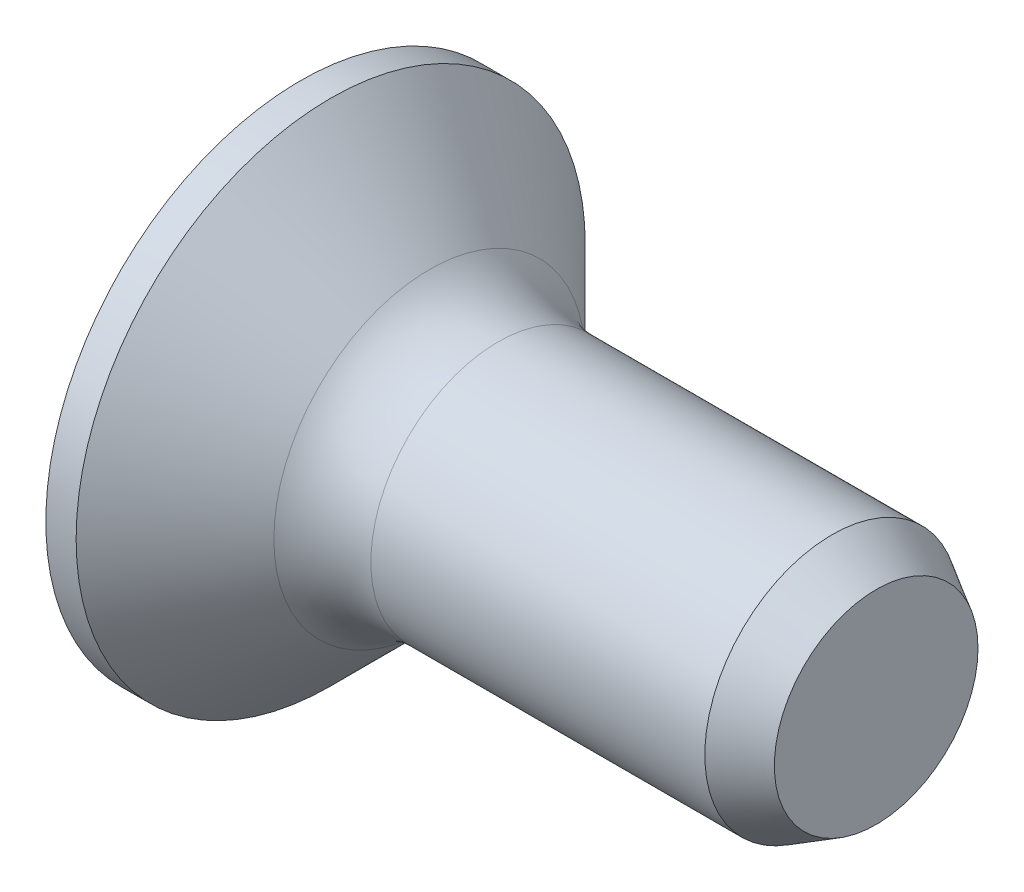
ISO-10303-21;
HEADER;
FILE_DESCRIPTION(('STEP AP214'),'2;1');
FILE_NAME('part.step','',(''),(''),'','','');
FILE_SCHEMA(('AUTOMOTIVE_DESIGN { 1 0 10303 214 1 1 1 1 }'));
ENDSEC;
DATA;
#1=APPLICATION_CONTEXT('core data for automotive mechanical design processes');
#2=APPLICATION_PROTOCOL_DEFINITION('international standard','automotive_design',2000,#1);
#3=PRODUCT_CONTEXT('',#1,'mechanical');
#4=PRODUCT('Part','Part','',(#3));
#5=PRODUCT_RELATED_PRODUCT_CATEGORY('part','',(#4));
#6=PRODUCT_DEFINITION_FORMATION('','',#4);
#7=PRODUCT_DEFINITION_CONTEXT('part definition',#1,'design');
#8=PRODUCT_DEFINITION('design','',#6,#7);
#9=PRODUCT_DEFINITION_SHAPE('','',#8);
#10=(LENGTH_UNIT() NAMED_UNIT(*) SI_UNIT(.MILLI.,.METRE.));
#11=(NAMED_UNIT(*) PLANE_ANGLE_UNIT() SI_UNIT($,.RADIAN.));
#12=(NAMED_UNIT(*) SI_UNIT($,.STERADIAN.) SOLID_ANGLE_UNIT());
#13=UNCERTAINTY_MEASURE_WITH_UNIT(LENGTH_MEASURE(1.E-05),#10,'distance_accuracy_value','');
#14=(GEOMETRIC_REPRESENTATION_CONTEXT(3) GLOBAL_UNCERTAINTY_ASSIGNED_CONTEXT((#13)) GLOBAL_UNIT_ASSIGNED_CONTEXT((#10,
#11,#12)) REPRESENTATION_CONTEXT('',''));
#15=CARTESIAN_POINT('',(0.,0.,0.));
#16=DIRECTION('',(0.,0.,1.));
#17=DIRECTION('',(1.,0.,0.));
#18=AXIS2_PLACEMENT_3D('',#15,#16,#17);
#19=CARTESIAN_POINT('',(0.,0.575,0.574999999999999));
#20=DIRECTION('',(-0.139173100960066,-0.99026806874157,0.));
#21=DIRECTION('',(0.99026806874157,-0.139173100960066,0.));
#22=AXIS2_PLACEMENT_3D('',#19,#20,#21);
#23=PLANE('',#22);
#24=DIRECTION('',(-0.980814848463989,0.137844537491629,0.137844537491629));
#25=VECTOR('',#24,1.);
#26=CARTESIAN_POINT('',(2.1,0.279864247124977,0.554714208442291));
#27=LINE('',#26,#25);
#28=CARTESIAN_POINT('',(2.1,0.279864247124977,0.554714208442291));
#29=VERTEX_POINT('',#28);
#30=CARTESIAN_POINT('',(0.,0.575000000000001,0.849849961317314));
#31=VERTEX_POINT('',#30);
#32=EDGE_CURVE('E378',#29,#31,#27,.T.);
#33=ORIENTED_EDGE('',*,*,#32,.F.);
#34=DIRECTION('',(0.,0.,1.));
#35=VECTOR('',#34,1.);
#36=CARTESIAN_POINT('',(2.1,0.279864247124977,0.574999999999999));
#37=LINE('',#36,#35);
#38=CARTESIAN_POINT('',(2.1,0.279864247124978,0.829564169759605));
#39=VERTEX_POINT('',#38);
#40=EDGE_CURVE('E217',#39,#29,#37,.F.);
#41=ORIENTED_EDGE('',*,*,#40,.F.);
#42=DIRECTION('',(-0.813777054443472,0.114368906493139,0.569812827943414));
#43=VECTOR('',#42,1.);
#44=CARTESIAN_POINT('',(0.,0.575000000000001,2.3));
#45=LINE('',#44,#43);
#46=CARTESIAN_POINT('',(0.,0.575000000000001,2.3));
#47=VERTEX_POINT('',#46);
#48=EDGE_CURVE('E212',#39,#47,#45,.T.);
#49=ORIENTED_EDGE('',*,*,#48,.T.);
#50=DIRECTION('',(0.,0.,-1.));
#51=VECTOR('',#50,1.);
#52=CARTESIAN_POINT('',(0.,0.575,0.574999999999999));
#53=LINE('',#52,#51);
#54=EDGE_CURVE('E299',#47,#31,#53,.T.);
#55=ORIENTED_EDGE('',*,*,#54,.T.);
#56=EDGE_LOOP('',(#33,#41,#49,#55));
#57=FACE_BOUND('',#56,.T.);
#58=ADVANCED_FACE('F104',(#57),#23,.T.);
#59=CARTESIAN_POINT('',(0.,-0.575,0.574999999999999));
#60=DIRECTION('',(-0.139173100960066,0.99026806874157,0.));
#61=DIRECTION('',(-0.99026806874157,-0.139173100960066,0.));
#62=AXIS2_PLACEMENT_3D('',#59,#60,#61);
#63=PLANE('',#62);
#64=DIRECTION('',(-0.980814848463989,-0.137844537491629,0.137844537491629));
#65=VECTOR('',#64,1.);
#66=CARTESIAN_POINT('',(1.05,-0.427432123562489,0.702282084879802));
#67=LINE('',#66,#65);
#68=CARTESIAN_POINT('',(2.1,-0.279864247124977,0.554714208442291));
#69=VERTEX_POINT('',#68);
#70=CARTESIAN_POINT('',(0.,-0.575000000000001,0.849849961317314));
#71=VERTEX_POINT('',#70);
#72=EDGE_CURVE('E432',#69,#71,#67,.T.);
#73=ORIENTED_EDGE('',*,*,#72,.T.);
#74=DIRECTION('',(0.,0.,1.));
#75=VECTOR('',#74,1.);
#76=CARTESIAN_POINT('',(0.,-0.575,0.574999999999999));
#77=LINE('',#76,#75);
#78=CARTESIAN_POINT('',(0.,-0.574999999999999,2.3));
#79=VERTEX_POINT('',#78);
#80=EDGE_CURVE('E210',#71,#79,#77,.T.);
#81=ORIENTED_EDGE('',*,*,#80,.T.);
#82=DIRECTION('',(-0.813777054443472,-0.114368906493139,0.569812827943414));
#83=VECTOR('',#82,1.);
#84=CARTESIAN_POINT('',(0.799883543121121,-0.462583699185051,1.7399155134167));
#85=LINE('',#84,#83);
#86=CARTESIAN_POINT('',(2.1,-0.279864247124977,0.829564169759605));
#87=VERTEX_POINT('',#86);
#88=EDGE_CURVE('E202',#87,#79,#85,.T.);
#89=ORIENTED_EDGE('',*,*,#88,.F.);
#90=DIRECTION('',(0.,0.,-1.));
#91=VECTOR('',#90,1.);
#92=CARTESIAN_POINT('',(2.1,-0.279864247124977,0.574999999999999));
#93=LINE('',#92,#91);
#94=EDGE_CURVE('E190',#69,#87,#93,.F.);
#95=ORIENTED_EDGE('',*,*,#94,.F.);
#96=EDGE_LOOP('',(#73,#81,#89,#95));
#97=FACE_BOUND('',#96,.T.);
#98=ADVANCED_FACE('F203',(#97),#63,.T.);
#99=CARTESIAN_POINT('',(0.,-0.575,0.574999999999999));
#100=DIRECTION('',(-0.139173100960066,0.,-0.99026806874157));
#101=DIRECTION('',(-0.99026806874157,0.,0.139173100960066));
#102=AXIS2_PLACEMENT_3D('',#99,#100,#101);
#103=PLANE('',#102);
#104=DIRECTION('',(-0.980814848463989,-0.137844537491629,0.13784453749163));
#105=VECTOR('',#104,1.);
#106=CARTESIAN_POINT('',(2.1,-0.554714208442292,0.279864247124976));
#107=LINE('',#106,#105);
#108=CARTESIAN_POINT('',(2.1,-0.554714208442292,0.279864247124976));
#109=VERTEX_POINT('',#108);
#110=CARTESIAN_POINT('',(0.,-0.849849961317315,0.575000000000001));
#111=VERTEX_POINT('',#110);
#112=EDGE_CURVE('E430',#109,#111,#107,.T.);
#113=ORIENTED_EDGE('',*,*,#112,.F.);
#114=DIRECTION('',(0.,-1.,0.));
#115=VECTOR('',#114,1.);
#116=CARTESIAN_POINT('',(2.1,-0.575,0.279864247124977));
#117=LINE('',#116,#115);
#118=CARTESIAN_POINT('',(2.1,-0.829564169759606,0.279864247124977));
#119=VERTEX_POINT('',#118);
#120=EDGE_CURVE('E197',#119,#109,#117,.F.);
#121=ORIENTED_EDGE('',*,*,#120,.F.);
#122=DIRECTION('',(-0.813777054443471,-0.569812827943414,0.11436890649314));
#123=VECTOR('',#122,1.);
#124=CARTESIAN_POINT('',(0.107031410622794,-2.2250557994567,0.559957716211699));
#125=LINE('',#124,#123);
#126=CARTESIAN_POINT('',(0.,-2.3,0.575000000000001));
#127=VERTEX_POINT('',#126);
#128=EDGE_CURVE('E183',#119,#127,#125,.T.);
#129=ORIENTED_EDGE('',*,*,#128,.T.);
#130=DIRECTION('',(0.,1.,0.));
#131=VECTOR('',#130,1.);
#132=CARTESIAN_POINT('',(0.,-0.575,0.574999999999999));
#133=LINE('',#132,#131);
#134=EDGE_CURVE('E290',#127,#111,#133,.T.);
#135=ORIENTED_EDGE('',*,*,#134,.T.);
#136=EDGE_LOOP('',(#113,#121,#129,#135));
#137=FACE_BOUND('',#136,.T.);
#138=ADVANCED_FACE('F529',(#137),#103,.T.);
#139=CARTESIAN_POINT('',(0.,-0.575,-0.574999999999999));
#140=DIRECTION('',(-0.139173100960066,0.,0.99026806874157));
#141=DIRECTION('',(0.99026806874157,0.,0.139173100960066));
#142=AXIS2_PLACEMENT_3D('',#139,#140,#141);
#143=PLANE('',#142);
#144=DIRECTION('',(-0.980814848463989,-0.137844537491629,-0.137844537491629));
#145=VECTOR('',#144,1.);
#146=CARTESIAN_POINT('',(1.05,-0.702282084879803,-0.427432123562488));
#147=LINE('',#146,#145);
#148=CARTESIAN_POINT('',(2.1,-0.554714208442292,-0.279864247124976));
#149=VERTEX_POINT('',#148);
#150=CARTESIAN_POINT('',(0.,-0.849849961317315,-0.574999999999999));
#151=VERTEX_POINT('',#150);
#152=EDGE_CURVE('E425',#149,#151,#147,.T.);
#153=ORIENTED_EDGE('',*,*,#152,.T.);
#154=DIRECTION('',(0.,-1.,0.));
#155=VECTOR('',#154,1.);
#156=CARTESIAN_POINT('',(0.,-0.575,-0.574999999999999));
#157=LINE('',#156,#155);
#158=CARTESIAN_POINT('',(0.,-2.3,-0.575000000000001));
#159=VERTEX_POINT('',#158);
#160=EDGE_CURVE('E284',#151,#159,#157,.T.);
#161=ORIENTED_EDGE('',*,*,#160,.T.);
#162=DIRECTION('',(-0.813777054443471,-0.569812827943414,-0.11436890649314));
#163=VECTOR('',#162,1.);
#164=CARTESIAN_POINT('',(0.799883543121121,-1.7399155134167,-0.462583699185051));
#165=LINE('',#164,#163);
#166=CARTESIAN_POINT('',(2.1,-0.829564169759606,-0.279864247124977));
#167=VERTEX_POINT('',#166);
#168=EDGE_CURVE('E242',#167,#159,#165,.T.);
#169=ORIENTED_EDGE('',*,*,#168,.F.);
#170=DIRECTION('',(0.,1.,0.));
#171=VECTOR('',#170,1.);
#172=CARTESIAN_POINT('',(2.1,-0.575,-0.279864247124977));
#173=LINE('',#172,#171);
#174=EDGE_CURVE('E226',#149,#167,#173,.F.);
#175=ORIENTED_EDGE('',*,*,#174,.F.);
#176=EDGE_LOOP('',(#153,#161,#169,#175));
#177=FACE_BOUND('',#176,.T.);
#178=ADVANCED_FACE('F535',(#177),#143,.T.);
#179=CARTESIAN_POINT('',(0.,-0.575,-0.574999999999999));
#180=DIRECTION('',(-0.139173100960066,0.99026806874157,0.));
#181=DIRECTION('',(-0.99026806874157,-0.139173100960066,0.));
#182=AXIS2_PLACEMENT_3D('',#179,#180,#181);
#183=PLANE('',#182);
#184=DIRECTION('',(-0.980814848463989,-0.137844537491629,-0.137844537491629));
#185=VECTOR('',#184,1.);
#186=CARTESIAN_POINT('',(2.1,-0.279864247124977,-0.554714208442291));
#187=LINE('',#186,#185);
#188=CARTESIAN_POINT('',(2.1,-0.279864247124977,-0.554714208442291));
#189=VERTEX_POINT('',#188);
#190=CARTESIAN_POINT('',(0.,-0.575,-0.849849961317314));
#191=VERTEX_POINT('',#190);
#192=EDGE_CURVE('E415',#189,#191,#187,.T.);
#193=ORIENTED_EDGE('',*,*,#192,.F.);
#194=DIRECTION('',(0.,0.,-1.));
#195=VECTOR('',#194,1.);
#196=CARTESIAN_POINT('',(2.1,-0.279864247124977,-0.574999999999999));
#197=LINE('',#196,#195);
#198=CARTESIAN_POINT('',(2.1,-0.279864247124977,-0.829564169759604));
#199=VERTEX_POINT('',#198);
#200=EDGE_CURVE('E232',#199,#189,#197,.F.);
#201=ORIENTED_EDGE('',*,*,#200,.F.);
#202=DIRECTION('',(-0.813777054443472,-0.114368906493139,-0.569812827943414));
#203=VECTOR('',#202,1.);
#204=CARTESIAN_POINT('',(0.107031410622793,-0.559957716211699,-2.2250557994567));
#205=LINE('',#204,#203);
#206=CARTESIAN_POINT('',(0.,-0.575,-2.3));
#207=VERTEX_POINT('',#206);
#208=EDGE_CURVE('E239',#199,#207,#205,.T.);
#209=ORIENTED_EDGE('',*,*,#208,.T.);
#210=DIRECTION('',(0.,0.,1.));
#211=VECTOR('',#210,1.);
#212=CARTESIAN_POINT('',(0.,-0.575,-0.574999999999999));
#213=LINE('',#212,#211);
#214=EDGE_CURVE('E276',#207,#191,#213,.T.);
#215=ORIENTED_EDGE('',*,*,#214,.T.);
#216=EDGE_LOOP('',(#193,#201,#209,#215));
#217=FACE_BOUND('',#216,.T.);
#218=ADVANCED_FACE('F520',(#217),#183,.T.);
#219=CARTESIAN_POINT('',(0.,0.575,-0.574999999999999));
#220=DIRECTION('',(-0.139173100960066,-0.99026806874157,0.));
#221=DIRECTION('',(0.99026806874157,-0.139173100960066,0.));
#222=AXIS2_PLACEMENT_3D('',#219,#220,#221);
#223=PLANE('',#222);
#224=DIRECTION('',(-0.980814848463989,0.137844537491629,-0.137844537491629));
#225=VECTOR('',#224,1.);
#226=CARTESIAN_POINT('',(1.05,0.427432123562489,-0.702282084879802));
#227=LINE('',#226,#225);
#228=CARTESIAN_POINT('',(2.1,0.279864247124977,-0.55471420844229));
#229=VERTEX_POINT('',#228);
#230=CARTESIAN_POINT('',(0.,0.575,-0.849849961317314));
#231=VERTEX_POINT('',#230);
#232=EDGE_CURVE('E410',#229,#231,#227,.T.);
#233=ORIENTED_EDGE('',*,*,#232,.T.);
#234=DIRECTION('',(0.,0.,-1.));
#235=VECTOR('',#234,1.);
#236=CARTESIAN_POINT('',(0.,0.575,-0.574999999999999));
#237=LINE('',#236,#235);
#238=CARTESIAN_POINT('',(0.,0.574999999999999,-2.3));
#239=VERTEX_POINT('',#238);
#240=EDGE_CURVE('E262',#231,#239,#237,.T.);
#241=ORIENTED_EDGE('',*,*,#240,.T.);
#242=DIRECTION('',(-0.813777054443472,0.114368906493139,-0.569812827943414));
#243=VECTOR('',#242,1.);
#244=CARTESIAN_POINT('',(0.799883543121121,0.462583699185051,-1.7399155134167));
#245=LINE('',#244,#243);
#246=CARTESIAN_POINT('',(2.1,0.279864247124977,-0.829564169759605));
#247=VERTEX_POINT('',#246);
#248=EDGE_CURVE('E245',#247,#239,#245,.T.);
#249=ORIENTED_EDGE('',*,*,#248,.F.);
#250=DIRECTION('',(0.,0.,1.));
#251=VECTOR('',#250,1.);
#252=CARTESIAN_POINT('',(2.1,0.279864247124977,-0.574999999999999));
#253=LINE('',#252,#251);
#254=EDGE_CURVE('E235',#229,#247,#253,.F.);
#255=ORIENTED_EDGE('',*,*,#254,.F.);
#256=EDGE_LOOP('',(#233,#241,#249,#255));
#257=FACE_BOUND('',#256,.T.);
#258=ADVANCED_FACE('F514',(#257),#223,.T.);
#259=CARTESIAN_POINT('',(0.,2.3,-0.575));
#260=DIRECTION('',(-0.139173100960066,0.,0.99026806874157));
#261=DIRECTION('',(0.99026806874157,0.,0.139173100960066));
#262=AXIS2_PLACEMENT_3D('',#259,#260,#261);
#263=PLANE('',#262);
#264=DIRECTION('',(-0.980814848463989,0.137844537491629,-0.137844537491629));
#265=VECTOR('',#264,1.);
#266=CARTESIAN_POINT('',(2.1,0.554714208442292,-0.279864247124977));
#267=LINE('',#266,#265);
#268=CARTESIAN_POINT('',(2.1,0.554714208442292,-0.279864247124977));
#269=VERTEX_POINT('',#268);
#270=CARTESIAN_POINT('',(0.,0.849849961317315,-0.575));
#271=VERTEX_POINT('',#270);
#272=EDGE_CURVE('E401',#269,#271,#267,.T.);
#273=ORIENTED_EDGE('',*,*,#272,.F.);
#274=DIRECTION('',(0.,1.,0.));
#275=VECTOR('',#274,1.);
#276=CARTESIAN_POINT('',(2.1,2.3,-0.279864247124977));
#277=LINE('',#276,#275);
#278=CARTESIAN_POINT('',(2.1,0.829564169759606,-0.279864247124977));
#279=VERTEX_POINT('',#278);
#280=EDGE_CURVE('E237',#279,#269,#277,.F.);
#281=ORIENTED_EDGE('',*,*,#280,.F.);
#282=DIRECTION('',(-0.813777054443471,0.569812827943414,-0.114368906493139));
#283=VECTOR('',#282,1.);
#284=CARTESIAN_POINT('',(0.,2.3,-0.575));
#285=LINE('',#284,#283);
#286=CARTESIAN_POINT('',(0.,2.3,-0.575));
#287=VERTEX_POINT('',#286);
#288=EDGE_CURVE('E249',#279,#287,#285,.T.);
#289=ORIENTED_EDGE('',*,*,#288,.T.);
#290=DIRECTION('',(0.,-1.,0.));
#291=VECTOR('',#290,1.);
#292=CARTESIAN_POINT('',(0.,2.3,-0.575));
#293=LINE('',#292,#291);
#294=EDGE_CURVE('E263',#287,#271,#293,.T.);
#295=ORIENTED_EDGE('',*,*,#294,.T.);
#296=EDGE_LOOP('',(#273,#281,#289,#295));
#297=FACE_BOUND('',#296,.T.);
#298=ADVANCED_FACE('F333',(#297),#263,.T.);
#299=CARTESIAN_POINT('',(0.,0.,0.));
#300=DIRECTION('',(-1.,0.,0.));
#301=DIRECTION('',(0.,0.,1.));
#302=AXIS2_PLACEMENT_3D('',#299,#300,#301);
#303=PLANE('',#302);
#304=CARTESIAN_POINT('',(0.,0.849849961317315,0.849849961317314));
#305=DIRECTION('',(1.,0.,0.));
#306=DIRECTION('',(0.,0.,1.));
#307=AXIS2_PLACEMENT_3D('',#304,#305,#306);
#308=CIRCLE('',#307,0.274849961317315);
#309=CARTESIAN_POINT('',(0.,0.849849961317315,0.574999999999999));
#310=VERTEX_POINT('',#309);
#311=EDGE_CURVE('E369',#31,#310,#308,.T.);
#312=ORIENTED_EDGE('',*,*,#311,.F.);
#313=ORIENTED_EDGE('',*,*,#54,.F.);
#314=DIRECTION('',(0.,1.,0.));
#315=VECTOR('',#314,1.);
#316=CARTESIAN_POINT('',(0.,0.575000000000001,2.3));
#317=LINE('',#316,#315);
#318=EDGE_CURVE('E297',#79,#47,#317,.T.);
#319=ORIENTED_EDGE('',*,*,#318,.F.);
#320=ORIENTED_EDGE('',*,*,#80,.F.);
#321=CARTESIAN_POINT('',(0.,-0.849849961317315,0.849849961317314));
#322=DIRECTION('',(1.,0.,0.));
#323=DIRECTION('',(0.,0.,1.));
#324=AXIS2_PLACEMENT_3D('',#321,#322,#323);
#325=CIRCLE('',#324,0.274849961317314);
#326=EDGE_CURVE('E314',#111,#71,#325,.T.);
#327=ORIENTED_EDGE('',*,*,#326,.F.);
#328=ORIENTED_EDGE('',*,*,#134,.F.);
#329=DIRECTION('',(0.,0.,1.));
#330=VECTOR('',#329,1.);
#331=CARTESIAN_POINT('',(0.,-2.3,-0.575000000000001));
#332=LINE('',#331,#330);
#333=EDGE_CURVE('E287',#159,#127,#332,.T.);
#334=ORIENTED_EDGE('',*,*,#333,.F.);
#335=ORIENTED_EDGE('',*,*,#160,.F.);
#336=CARTESIAN_POINT('',(0.,-0.849849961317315,-0.849849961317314));
#337=DIRECTION('',(1.,0.,0.));
#338=DIRECTION('',(0.,0.,-1.));
#339=AXIS2_PLACEMENT_3D('',#336,#337,#338);
#340=CIRCLE('',#339,0.274849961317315);
#341=EDGE_CURVE('E737',#191,#151,#340,.T.);
#342=ORIENTED_EDGE('',*,*,#341,.F.);
#343=ORIENTED_EDGE('',*,*,#214,.F.);
#344=DIRECTION('',(0.,-1.,0.));
#345=VECTOR('',#344,1.);
#346=CARTESIAN_POINT('',(0.,0.574999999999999,-2.3));
#347=LINE('',#346,#345);
#348=EDGE_CURVE('E273',#239,#207,#347,.T.);
#349=ORIENTED_EDGE('',*,*,#348,.F.);
#350=ORIENTED_EDGE('',*,*,#240,.F.);
#351=CARTESIAN_POINT('',(0.,0.849849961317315,-0.849849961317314));
#352=DIRECTION('',(1.,0.,0.));
#353=DIRECTION('',(0.,0.,-1.));
#354=AXIS2_PLACEMENT_3D('',#351,#352,#353);
#355=CIRCLE('',#354,0.274849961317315);
#356=EDGE_CURVE('E360',#271,#231,#355,.T.);
#357=ORIENTED_EDGE('',*,*,#356,.F.);
#358=ORIENTED_EDGE('',*,*,#294,.F.);
#359=DIRECTION('',(0.,0.,-1.));
#360=VECTOR('',#359,1.);
#361=CARTESIAN_POINT('',(0.,2.3,-0.575));
#362=LINE('',#361,#360);
#363=CARTESIAN_POINT('',(0.,2.3,0.575));
#364=VERTEX_POINT('',#363);
#365=EDGE_CURVE('E153',#364,#287,#362,.T.);
#366=ORIENTED_EDGE('',*,*,#365,.F.);
#367=DIRECTION('',(0.,1.,0.));
#368=VECTOR('',#367,1.);
#369=CARTESIAN_POINT('',(0.,2.3,0.575));
#370=LINE('',#369,#368);
#371=EDGE_CURVE('E240',#310,#364,#370,.T.);
#372=ORIENTED_EDGE('',*,*,#371,.F.);
#373=EDGE_LOOP('',(#312,#313,#319,#320,#327,#328,#334,#335,#342,#343,#349,#350,#357,#358,#366,#372));
#374=FACE_BOUND('',#373,.T.);
#375=CARTESIAN_POINT('',(0.,0.,0.));
#376=DIRECTION('',(1.,0.,0.));
#377=DIRECTION('',(0.,0.,-1.));
#378=AXIS2_PLACEMENT_3D('',#375,#376,#377);
#379=CIRCLE('',#378,4.2);
#380=CARTESIAN_POINT('',(0.,0.,-4.2));
#381=VERTEX_POINT('',#380);
#382=EDGE_CURVE('E712',#381,#381,#379,.T.);
#383=ORIENTED_EDGE('',*,*,#382,.F.);
#384=EDGE_LOOP('',(#383));
#385=FACE_BOUND('',#384,.T.);
#386=ADVANCED_FACE('F316',(#374,#385),#303,.T.);
#387=CARTESIAN_POINT('',(6.62068469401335,0.,0.));
#388=DIRECTION('',(1.,0.,0.));
#389=DIRECTION('',(0.,0.,-1.));
#390=AXIS2_PLACEMENT_3D('',#387,#388,#389);
#391=CYLINDRICAL_SURFACE('',#390,4.2);
#392=ORIENTED_EDGE('',*,*,#382,.T.);
#393=EDGE_LOOP('',(#392));
#394=FACE_BOUND('',#393,.T.);
#395=CARTESIAN_POINT('',(0.499999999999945,0.,0.));
#396=DIRECTION('',(1.,0.,0.));
#397=DIRECTION('',(0.,0.,-1.));
#398=AXIS2_PLACEMENT_3D('',#395,#396,#397);
#399=CIRCLE('',#398,4.2);
#400=CARTESIAN_POINT('',(0.499999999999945,0.,-4.2));
#401=VERTEX_POINT('',#400);
#402=EDGE_CURVE('E256',#401,#401,#399,.T.);
#403=ORIENTED_EDGE('',*,*,#402,.F.);
#404=EDGE_LOOP('',(#403));
#405=FACE_BOUND('',#404,.T.);
#406=ADVANCED_FACE('F327',(#394,#405),#391,.T.);
#407=CARTESIAN_POINT('',(2.6,0.,0.));
#408=DIRECTION('',(-1.,0.,0.));
#409=DIRECTION('',(0.,0.,1.));
#410=AXIS2_PLACEMENT_3D('',#407,#408,#409);
#411=CONICAL_SURFACE('',#410,2.1,0.785398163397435);
#412=CARTESIAN_POINT('',(2.13137084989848,0.,0.));
#413=DIRECTION('',(-1.,0.,0.));
#414=DIRECTION('',(0.,0.,1.));
#415=AXIS2_PLACEMENT_3D('',#412,#413,#414);
#416=CIRCLE('',#415,2.56862915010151);
#417=CARTESIAN_POINT('',(2.13137084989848,0.,2.56862915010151));
#418=VERTEX_POINT('',#417);
#419=EDGE_CURVE('E12',#418,#418,#416,.T.);
#420=ORIENTED_EDGE('',*,*,#419,.T.);
#421=EDGE_LOOP('',(#420));
#422=FACE_BOUND('',#421,.T.);
#423=ORIENTED_EDGE('',*,*,#402,.T.);
#424=EDGE_LOOP('',(#423));
#425=FACE_BOUND('',#424,.T.);
#426=ADVANCED_FACE('F647',(#422,#425),#411,.T.);
#427=CARTESIAN_POINT('',(6.62068469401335,0.,0.));
#428=DIRECTION('',(1.,0.,0.));
#429=DIRECTION('',(0.,0.,-1.));
#430=AXIS2_PLACEMENT_3D('',#427,#428,#429);
#431=CYLINDRICAL_SURFACE('',#430,2.1);
#432=CARTESIAN_POINT('',(3.26274169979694,0.,0.));
#433=DIRECTION('',(1.,0.,0.));
#434=DIRECTION('',(0.,0.,-1.));
#435=AXIS2_PLACEMENT_3D('',#432,#433,#434);
#436=CIRCLE('',#435,2.1);
#437=CARTESIAN_POINT('',(3.26274169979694,0.,-2.1));
#438=VERTEX_POINT('',#437);
#439=EDGE_CURVE('E109',#438,#438,#436,.T.);
#440=ORIENTED_EDGE('',*,*,#439,.T.);
#441=EDGE_LOOP('',(#440));
#442=FACE_BOUND('',#441,.T.);
#443=CARTESIAN_POINT('',(8.77253866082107,0.,0.));
#444=DIRECTION('',(1.,0.,0.));
#445=DIRECTION('',(0.,0.,-1.));
#446=AXIS2_PLACEMENT_3D('',#443,#444,#445);
#447=CIRCLE('',#446,2.1);
#448=CARTESIAN_POINT('',(8.77253866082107,0.,-2.1));
#449=VERTEX_POINT('',#448);
#450=EDGE_CURVE('E225',#449,#449,#447,.F.);
#451=ORIENTED_EDGE('',*,*,#450,.T.);
#452=EDGE_LOOP('',(#451));
#453=FACE_BOUND('',#452,.T.);
#454=ADVANCED_FACE('F643',(#442,#453),#431,.T.);
#455=CARTESIAN_POINT('',(9.5,2.1,0.));
#456=DIRECTION('',(1.,0.,0.));
#457=DIRECTION('',(0.,0.,-1.));
#458=AXIS2_PLACEMENT_3D('',#455,#456,#457);
#459=PLANE('',#458);
#460=CARTESIAN_POINT('',(9.5,0.,0.));
#461=DIRECTION('',(1.,0.,0.));
#462=DIRECTION('',(0.,0.,-1.));
#463=AXIS2_PLACEMENT_3D('',#460,#461,#462);
#464=CIRCLE('',#463,1.67999999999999);
#465=CARTESIAN_POINT('',(9.5,0.,-1.67999999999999));
#466=VERTEX_POINT('',#465);
#467=EDGE_CURVE('E714',#466,#466,#464,.T.);
#468=ORIENTED_EDGE('',*,*,#467,.T.);
#469=EDGE_LOOP('',(#468));
#470=FACE_BOUND('',#469,.T.);
#471=ADVANCED_FACE('F495',(#470),#459,.T.);
#472=CARTESIAN_POINT('',(9.5,0.,0.));
#473=DIRECTION('',(-1.,0.,0.));
#474=DIRECTION('',(0.,0.,1.));
#475=AXIS2_PLACEMENT_3D('',#472,#473,#474);
#476=CONICAL_SURFACE('',#475,1.67999999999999,0.523598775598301);
#477=ORIENTED_EDGE('',*,*,#450,.F.);
#478=EDGE_LOOP('',(#477));
#479=FACE_BOUND('',#478,.T.);
#480=ORIENTED_EDGE('',*,*,#467,.F.);
#481=EDGE_LOOP('',(#480));
#482=FACE_BOUND('',#481,.T.);
#483=ADVANCED_FACE('F331',(#479,#482),#476,.T.);
#484=CARTESIAN_POINT('',(0.,2.3,-0.575));
#485=DIRECTION('',(-0.573576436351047,-0.819152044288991,0.));
#486=DIRECTION('',(0.819152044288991,-0.573576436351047,0.));
#487=AXIS2_PLACEMENT_3D('',#484,#485,#486);
#488=PLANE('',#487);
#489=ORIENTED_EDGE('',*,*,#365,.T.);
#490=ORIENTED_EDGE('',*,*,#288,.F.);
#491=DIRECTION('',(0.,0.,1.));
#492=VECTOR('',#491,1.);
#493=CARTESIAN_POINT('',(2.1,0.829564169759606,-0.575));
#494=LINE('',#493,#492);
#495=CARTESIAN_POINT('',(2.1,0.829564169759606,0.279864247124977));
#496=VERTEX_POINT('',#495);
#497=EDGE_CURVE('E231',#496,#279,#494,.F.);
#498=ORIENTED_EDGE('',*,*,#497,.F.);
#499=DIRECTION('',(-0.813777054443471,0.569812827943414,0.114368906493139));
#500=VECTOR('',#499,1.);
#501=CARTESIAN_POINT('',(0.,2.3,0.575));
#502=LINE('',#501,#500);
#503=EDGE_CURVE('E253',#496,#364,#502,.T.);
#504=ORIENTED_EDGE('',*,*,#503,.T.);
#505=EDGE_LOOP('',(#489,#490,#498,#504));
#506=FACE_BOUND('',#505,.T.);
#507=ADVANCED_FACE('F512',(#506),#488,.T.);
#508=CARTESIAN_POINT('',(0.,2.3,0.575));
#509=DIRECTION('',(-0.139173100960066,0.,-0.99026806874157));
#510=DIRECTION('',(-0.99026806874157,0.,0.139173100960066));
#511=AXIS2_PLACEMENT_3D('',#508,#509,#510);
#512=PLANE('',#511);
#513=DIRECTION('',(0.,-1.,0.));
#514=VECTOR('',#513,1.);
#515=CARTESIAN_POINT('',(2.1,2.3,0.279864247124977));
#516=LINE('',#515,#514);
#517=CARTESIAN_POINT('',(2.1,0.554714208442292,0.279864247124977));
#518=VERTEX_POINT('',#517);
#519=EDGE_CURVE('E218',#518,#496,#516,.F.);
#520=ORIENTED_EDGE('',*,*,#519,.F.);
#521=DIRECTION('',(-0.980814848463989,0.137844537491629,0.137844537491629));
#522=VECTOR('',#521,1.);
#523=CARTESIAN_POINT('',(2.1,0.554714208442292,0.279864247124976));
#524=LINE('',#523,#522);
#525=EDGE_CURVE('E406',#518,#310,#524,.T.);
#526=ORIENTED_EDGE('',*,*,#525,.T.);
#527=ORIENTED_EDGE('',*,*,#371,.T.);
#528=ORIENTED_EDGE('',*,*,#503,.F.);
#529=EDGE_LOOP('',(#520,#526,#527,#528));
#530=FACE_BOUND('',#529,.T.);
#531=ADVANCED_FACE('F506',(#530),#512,.T.);
#532=CARTESIAN_POINT('',(0.,0.575000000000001,2.3));
#533=DIRECTION('',(-0.573576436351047,0.,-0.819152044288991));
#534=DIRECTION('',(-0.819152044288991,0.,0.573576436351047));
#535=AXIS2_PLACEMENT_3D('',#532,#533,#534);
#536=PLANE('',#535);
#537=ORIENTED_EDGE('',*,*,#318,.T.);
#538=ORIENTED_EDGE('',*,*,#48,.F.);
#539=DIRECTION('',(0.,-1.,0.));
#540=VECTOR('',#539,1.);
#541=CARTESIAN_POINT('',(2.1,0.575,0.829564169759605));
#542=LINE('',#541,#540);
#543=EDGE_CURVE('E193',#87,#39,#542,.F.);
#544=ORIENTED_EDGE('',*,*,#543,.F.);
#545=ORIENTED_EDGE('',*,*,#88,.T.);
#546=EDGE_LOOP('',(#537,#538,#544,#545));
#547=FACE_BOUND('',#546,.T.);
#548=ADVANCED_FACE('F214',(#547),#536,.T.);
#549=CARTESIAN_POINT('',(0.,-2.3,-0.575000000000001));
#550=DIRECTION('',(-0.573576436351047,0.819152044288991,0.));
#551=DIRECTION('',(-0.819152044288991,-0.573576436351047,0.));
#552=AXIS2_PLACEMENT_3D('',#549,#550,#551);
#553=PLANE('',#552);
#554=ORIENTED_EDGE('',*,*,#333,.T.);
#555=ORIENTED_EDGE('',*,*,#128,.F.);
#556=DIRECTION('',(0.,0.,-1.));
#557=VECTOR('',#556,1.);
#558=CARTESIAN_POINT('',(2.1,-0.829564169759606,-0.575000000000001));
#559=LINE('',#558,#557);
#560=EDGE_CURVE('E221',#167,#119,#559,.F.);
#561=ORIENTED_EDGE('',*,*,#560,.F.);
#562=ORIENTED_EDGE('',*,*,#168,.T.);
#563=EDGE_LOOP('',(#554,#555,#561,#562));
#564=FACE_BOUND('',#563,.T.);
#565=ADVANCED_FACE('F542',(#564),#553,.T.);
#566=CARTESIAN_POINT('',(0.,0.574999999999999,-2.3));
#567=DIRECTION('',(-0.573576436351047,0.,0.819152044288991));
#568=DIRECTION('',(0.819152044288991,0.,0.573576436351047));
#569=AXIS2_PLACEMENT_3D('',#566,#567,#568);
#570=PLANE('',#569);
#571=ORIENTED_EDGE('',*,*,#348,.T.);
#572=ORIENTED_EDGE('',*,*,#208,.F.);
#573=DIRECTION('',(0.,1.,0.));
#574=VECTOR('',#573,1.);
#575=CARTESIAN_POINT('',(2.1,0.575000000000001,-0.829564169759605));
#576=LINE('',#575,#574);
#577=EDGE_CURVE('E230',#247,#199,#576,.F.);
#578=ORIENTED_EDGE('',*,*,#577,.F.);
#579=ORIENTED_EDGE('',*,*,#248,.T.);
#580=EDGE_LOOP('',(#571,#572,#578,#579));
#581=FACE_BOUND('',#580,.T.);
#582=ADVANCED_FACE('F490',(#581),#570,.T.);
#583=CARTESIAN_POINT('',(2.1,2.3,-0.575));
#584=DIRECTION('',(1.,0.,0.));
#585=DIRECTION('',(0.,0.,-1.));
#586=AXIS2_PLACEMENT_3D('',#583,#584,#585);
#587=PLANE('',#586);
#588=ORIENTED_EDGE('',*,*,#280,.T.);
#589=CARTESIAN_POINT('',(2.1,0.554714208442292,-0.279864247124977));
#590=CARTESIAN_POINT('',(2.1,0.546925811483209,-0.27986884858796));
#591=CARTESIAN_POINT('',(2.1,0.539146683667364,-0.280251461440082));
#592=CARTESIAN_POINT('',(2.1,0.523659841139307,-0.281712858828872));
#593=CARTESIAN_POINT('',(2.1,0.515952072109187,-0.282791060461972));
#594=CARTESIAN_POINT('',(2.1,0.492949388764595,-0.286988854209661));
#595=CARTESIAN_POINT('',(2.1,0.477822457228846,-0.291070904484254));
#596=CARTESIAN_POINT('',(2.1,0.448466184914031,-0.30154495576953));
#597=CARTESIAN_POINT('',(2.1,0.434233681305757,-0.307928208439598));
#598=CARTESIAN_POINT('',(2.1,0.407003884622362,-0.322905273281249));
#599=CARTESIAN_POINT('',(2.1,0.394004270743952,-0.331494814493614));
#600=CARTESIAN_POINT('',(2.1,0.369409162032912,-0.351121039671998));
#601=CARTESIAN_POINT('',(2.1,0.357860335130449,-0.362216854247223));
#602=CARTESIAN_POINT('',(2.1,0.337033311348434,-0.386378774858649));
#603=CARTESIAN_POINT('',(2.1,0.327757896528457,-0.399447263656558));
#604=CARTESIAN_POINT('',(2.1,0.312181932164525,-0.425850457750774));
#605=CARTESIAN_POINT('',(2.1,0.305704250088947,-0.439082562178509));
#606=CARTESIAN_POINT('',(2.1,0.294796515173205,-0.466353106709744));
#607=CARTESIAN_POINT('',(2.1,0.290364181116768,-0.480390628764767));
#608=CARTESIAN_POINT('',(2.1,0.284721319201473,-0.504519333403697));
#609=CARTESIAN_POINT('',(2.1,0.282937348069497,-0.514478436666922));
#610=CARTESIAN_POINT('',(2.1,0.280515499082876,-0.534524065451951));
#611=CARTESIAN_POINT('',(2.1,0.279876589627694,-0.544610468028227));
#612=CARTESIAN_POINT('',(2.1,0.279864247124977,-0.55471420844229));
#613=B_SPLINE_CURVE_WITH_KNOTS('',3,(#589,#590,#591,#592,#593,#594,#595,#596,#597,#598,#599,
#600,#601,#602,#603,#604,#605,#606,#607,#608,#609,#610,#611,#612),.UNSPECIFIED.,.F.,.F.,(4,2,2,
2,2,2,2,2,2,2,2,4),(0.,0.023340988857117,0.0466624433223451,0.0934456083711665,
0.140052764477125,0.186570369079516,0.234328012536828,0.282143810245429,0.326181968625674,
0.370170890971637,0.400463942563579,0.43072968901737),.UNSPECIFIED.);
#614=EDGE_CURVE('E141',#269,#229,#613,.T.);
#615=ORIENTED_EDGE('',*,*,#614,.T.);
#616=ORIENTED_EDGE('',*,*,#254,.T.);
#617=ORIENTED_EDGE('',*,*,#577,.T.);
#618=ORIENTED_EDGE('',*,*,#200,.T.);
#619=CARTESIAN_POINT('',(2.1,-0.279864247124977,-0.554714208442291));
#620=CARTESIAN_POINT('',(2.1,-0.279868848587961,-0.546925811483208));
#621=CARTESIAN_POINT('',(2.1,-0.280251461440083,-0.539146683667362));
#622=CARTESIAN_POINT('',(2.1,-0.281712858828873,-0.523659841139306));
#623=CARTESIAN_POINT('',(2.1,-0.282791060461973,-0.515952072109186));
#624=CARTESIAN_POINT('',(2.1,-0.286988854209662,-0.492949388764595));
#625=CARTESIAN_POINT('',(2.1,-0.291070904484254,-0.477822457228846));
#626=CARTESIAN_POINT('',(2.1,-0.30154495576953,-0.448466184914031));
#627=CARTESIAN_POINT('',(2.1,-0.307928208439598,-0.434233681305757));
#628=CARTESIAN_POINT('',(2.1,-0.322905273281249,-0.407003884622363));
#629=CARTESIAN_POINT('',(2.1,-0.331494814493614,-0.394004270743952));
#630=CARTESIAN_POINT('',(2.1,-0.351121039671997,-0.369409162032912));
#631=CARTESIAN_POINT('',(2.1,-0.362216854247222,-0.35786033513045));
#632=CARTESIAN_POINT('',(2.1,-0.386378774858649,-0.337033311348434));
#633=CARTESIAN_POINT('',(2.1,-0.399447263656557,-0.327757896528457));
#634=CARTESIAN_POINT('',(2.1,-0.425850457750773,-0.312181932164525));
#635=CARTESIAN_POINT('',(2.1,-0.439082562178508,-0.305704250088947));
#636=CARTESIAN_POINT('',(2.1,-0.466353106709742,-0.294796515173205));
#637=CARTESIAN_POINT('',(2.1,-0.480390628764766,-0.290364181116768));
#638=CARTESIAN_POINT('',(2.1,-0.504519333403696,-0.284721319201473));
#639=CARTESIAN_POINT('',(2.1,-0.514478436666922,-0.282937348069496));
#640=CARTESIAN_POINT('',(2.1,-0.534524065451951,-0.280515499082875));
#641=CARTESIAN_POINT('',(2.1,-0.544610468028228,-0.279876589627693));
#642=CARTESIAN_POINT('',(2.1,-0.554714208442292,-0.279864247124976));
#643=B_SPLINE_CURVE_WITH_KNOTS('',3,(#619,#620,#621,#622,#623,#624,#625,#626,#627,#628,#629,
#630,#631,#632,#633,#634,#635,#636,#637,#638,#639,#640,#641,#642),.UNSPECIFIED.,.F.,.F.,(4,2,2,
2,2,2,2,2,2,2,2,4),(0.,0.0233409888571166,0.0466624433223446,0.0934456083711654,
0.140052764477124,0.186570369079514,0.234328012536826,0.282143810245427,0.326181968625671,
0.370170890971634,0.400463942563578,0.430729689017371),.UNSPECIFIED.);
#644=EDGE_CURVE('E480',#189,#149,#643,.T.);
#645=ORIENTED_EDGE('',*,*,#644,.T.);
#646=ORIENTED_EDGE('',*,*,#174,.T.);
#647=ORIENTED_EDGE('',*,*,#560,.T.);
#648=ORIENTED_EDGE('',*,*,#120,.T.);
#649=CARTESIAN_POINT('',(2.1,-0.554714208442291,0.279864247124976));
#650=CARTESIAN_POINT('',(2.1,-0.546925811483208,0.27986884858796));
#651=CARTESIAN_POINT('',(2.1,-0.539146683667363,0.280251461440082));
#652=CARTESIAN_POINT('',(2.1,-0.523659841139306,0.281712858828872));
#653=CARTESIAN_POINT('',(2.1,-0.515952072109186,0.282791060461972));
#654=CARTESIAN_POINT('',(2.1,-0.492949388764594,0.286988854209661));
#655=CARTESIAN_POINT('',(2.1,-0.477822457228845,0.291070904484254));
#656=CARTESIAN_POINT('',(2.1,-0.44846618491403,0.30154495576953));
#657=CARTESIAN_POINT('',(2.1,-0.434233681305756,0.307928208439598));
#658=CARTESIAN_POINT('',(2.1,-0.407003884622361,0.32290527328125));
#659=CARTESIAN_POINT('',(2.1,-0.394004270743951,0.331494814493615));
#660=CARTESIAN_POINT('',(2.1,-0.369409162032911,0.351121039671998));
#661=CARTESIAN_POINT('',(2.1,-0.357860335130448,0.362216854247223));
#662=CARTESIAN_POINT('',(2.1,-0.337033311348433,0.38637877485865));
#663=CARTESIAN_POINT('',(2.1,-0.327757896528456,0.399447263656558));
#664=CARTESIAN_POINT('',(2.1,-0.312181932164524,0.425850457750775));
#665=CARTESIAN_POINT('',(2.1,-0.305704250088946,0.43908256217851));
#666=CARTESIAN_POINT('',(2.1,-0.294796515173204,0.466353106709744));
#667=CARTESIAN_POINT('',(2.1,-0.290364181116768,0.480390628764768));
#668=CARTESIAN_POINT('',(2.1,-0.284721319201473,0.504519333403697));
#669=CARTESIAN_POINT('',(2.1,-0.282937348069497,0.514478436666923));
#670=CARTESIAN_POINT('',(2.1,-0.280515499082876,0.534524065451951));
#671=CARTESIAN_POINT('',(2.1,-0.279876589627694,0.544610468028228));
#672=CARTESIAN_POINT('',(2.1,-0.279864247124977,0.554714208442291));
#673=B_SPLINE_CURVE_WITH_KNOTS('',3,(#649,#650,#651,#652,#653,#654,#655,#656,#657,#658,#659,
#660,#661,#662,#663,#664,#665,#666,#667,#668,#669,#670,#671,#672),.UNSPECIFIED.,.F.,.F.,(4,2,2,
2,2,2,2,2,2,2,2,4),(0.,0.023340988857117,0.0466624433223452,0.0934456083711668,
0.140052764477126,0.186570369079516,0.234328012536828,0.28214381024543,0.326181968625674,
0.370170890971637,0.400463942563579,0.43072968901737),.UNSPECIFIED.);
#674=EDGE_CURVE('E194',#109,#69,#673,.T.);
#675=ORIENTED_EDGE('',*,*,#674,.T.);
#676=ORIENTED_EDGE('',*,*,#94,.T.);
#677=ORIENTED_EDGE('',*,*,#543,.T.);
#678=ORIENTED_EDGE('',*,*,#40,.T.);
#679=CARTESIAN_POINT('',(2.1,0.279864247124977,0.554714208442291));
#680=CARTESIAN_POINT('',(2.1,0.279868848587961,0.546925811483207));
#681=CARTESIAN_POINT('',(2.1,0.280251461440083,0.539146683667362));
#682=CARTESIAN_POINT('',(2.1,0.281712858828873,0.523659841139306));
#683=CARTESIAN_POINT('',(2.1,0.282791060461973,0.515952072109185));
#684=CARTESIAN_POINT('',(2.1,0.286988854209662,0.492949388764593));
#685=CARTESIAN_POINT('',(2.1,0.291070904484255,0.477822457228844));
#686=CARTESIAN_POINT('',(2.1,0.301544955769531,0.448466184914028));
#687=CARTESIAN_POINT('',(2.1,0.307928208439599,0.434233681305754));
#688=CARTESIAN_POINT('',(2.1,0.322905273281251,0.40700388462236));
#689=CARTESIAN_POINT('',(2.1,0.331494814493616,0.394004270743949));
#690=CARTESIAN_POINT('',(2.1,0.351121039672,0.369409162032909));
#691=CARTESIAN_POINT('',(2.1,0.362216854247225,0.357860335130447));
#692=CARTESIAN_POINT('',(2.1,0.386378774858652,0.337033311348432));
#693=CARTESIAN_POINT('',(2.1,0.399447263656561,0.327757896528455));
#694=CARTESIAN_POINT('',(2.1,0.425850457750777,0.312181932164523));
#695=CARTESIAN_POINT('',(2.1,0.439082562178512,0.305704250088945));
#696=CARTESIAN_POINT('',(2.1,0.466353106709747,0.294796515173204));
#697=CARTESIAN_POINT('',(2.1,0.48039062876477,0.290364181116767));
#698=CARTESIAN_POINT('',(2.1,0.504519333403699,0.284721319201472));
#699=CARTESIAN_POINT('',(2.1,0.514478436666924,0.282937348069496));
#700=CARTESIAN_POINT('',(2.1,0.534524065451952,0.280515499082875));
#701=CARTESIAN_POINT('',(2.1,0.544610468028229,0.279876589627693));
#702=CARTESIAN_POINT('',(2.1,0.554714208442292,0.279864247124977));
#703=B_SPLINE_CURVE_WITH_KNOTS('',3,(#679,#680,#681,#682,#683,#684,#685,#686,#687,#688,#689,
#690,#691,#692,#693,#694,#695,#696,#697,#698,#699,#700,#701,#702),.UNSPECIFIED.,.F.,.F.,(4,2,2,
2,2,2,2,2,2,2,2,4),(0.,0.0233409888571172,0.0466624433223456,0.0934456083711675,
0.140052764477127,0.186570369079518,0.23432801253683,0.282143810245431,0.326181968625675,
0.370170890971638,0.400463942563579,0.430729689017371),.UNSPECIFIED.);
#704=EDGE_CURVE('E118',#29,#518,#703,.T.);
#705=ORIENTED_EDGE('',*,*,#704,.T.);
#706=ORIENTED_EDGE('',*,*,#519,.T.);
#707=ORIENTED_EDGE('',*,*,#497,.T.);
#708=EDGE_LOOP('',(#588,#615,#616,#617,#618,#645,#646,#647,#648,#675,#676,#677,#678,#705,#706,#707));
#709=FACE_BOUND('',#708,.T.);
#710=ADVANCED_FACE('F187',(#709),#587,.F.);
#711=CARTESIAN_POINT('',(2.1,0.554714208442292,-0.279864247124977));
#712=CARTESIAN_POINT('',(0.,0.849849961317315,-0.574999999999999));
#713=CARTESIAN_POINT('',(2.1,0.489931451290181,-0.279864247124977));
#714=CARTESIAN_POINT('',(0.,0.785067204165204,-0.575));
#715=CARTESIAN_POINT('',(2.1,0.414033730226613,-0.306698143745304));
#716=CARTESIAN_POINT('',(0.,0.709169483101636,-0.601833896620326));
#717=CARTESIAN_POINT('',(2.1,0.306698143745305,-0.414033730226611));
#718=CARTESIAN_POINT('',(0.,0.601833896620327,-0.709169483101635));
#719=CARTESIAN_POINT('',(2.1,0.279864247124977,-0.489931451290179));
#720=CARTESIAN_POINT('',(0.,0.575000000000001,-0.785067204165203));
#721=CARTESIAN_POINT('',(2.1,0.279864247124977,-0.55471420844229));
#722=CARTESIAN_POINT('',(0.,0.575,-0.849849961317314));
#723=B_SPLINE_SURFACE_WITH_KNOTS('',3,1,((#711,#712),(#713,#714),(#715,#716),(#717,#718),(#719,
#720),(#721,#722)),.UNSPECIFIED.,.F.,.F.,.F.,(4,2,4),(2,2),(0.,0.5,1.),(0.,1.),.UNSPECIFIED.);
#724=ORIENTED_EDGE('',*,*,#614,.F.);
#725=ORIENTED_EDGE('',*,*,#272,.T.);
#726=ORIENTED_EDGE('',*,*,#356,.T.);
#727=ORIENTED_EDGE('',*,*,#232,.F.);
#728=EDGE_LOOP('',(#724,#725,#726,#727));
#729=FACE_BOUND('',#728,.T.);
#730=ADVANCED_FACE('F405',(#729),#723,.F.);
#731=CARTESIAN_POINT('',(2.1,-0.279864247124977,-0.554714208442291));
#732=CARTESIAN_POINT('',(0.,-0.575,-0.849849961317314));
#733=CARTESIAN_POINT('',(2.1,-0.279864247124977,-0.48993145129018));
#734=CARTESIAN_POINT('',(0.,-0.575,-0.785067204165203));
#735=CARTESIAN_POINT('',(2.1,-0.306698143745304,-0.414033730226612));
#736=CARTESIAN_POINT('',(0.,-0.601833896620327,-0.709169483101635));
#737=CARTESIAN_POINT('',(2.1,-0.414033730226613,-0.306698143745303));
#738=CARTESIAN_POINT('',(0.,-0.709169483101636,-0.601833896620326));
#739=CARTESIAN_POINT('',(2.1,-0.489931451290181,-0.279864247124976));
#740=CARTESIAN_POINT('',(0.,-0.785067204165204,-0.574999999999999));
#741=CARTESIAN_POINT('',(2.1,-0.554714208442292,-0.279864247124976));
#742=CARTESIAN_POINT('',(0.,-0.849849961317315,-0.574999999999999));
#743=B_SPLINE_SURFACE_WITH_KNOTS('',3,1,((#731,#732),(#733,#734),(#735,#736),(#737,#738),(#739,
#740),(#741,#742)),.UNSPECIFIED.,.F.,.F.,.F.,(4,2,4),(2,2),(0.,0.5,1.),(0.,1.),.UNSPECIFIED.);
#744=ORIENTED_EDGE('',*,*,#644,.F.);
#745=ORIENTED_EDGE('',*,*,#192,.T.);
#746=ORIENTED_EDGE('',*,*,#341,.T.);
#747=ORIENTED_EDGE('',*,*,#152,.F.);
#748=EDGE_LOOP('',(#744,#745,#746,#747));
#749=FACE_BOUND('',#748,.T.);
#750=ADVANCED_FACE('F457',(#749),#743,.F.);
#751=CARTESIAN_POINT('',(2.1,-0.554714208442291,0.279864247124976));
#752=CARTESIAN_POINT('',(0.,-0.849849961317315,0.575));
#753=CARTESIAN_POINT('',(2.1,-0.48993145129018,0.279864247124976));
#754=CARTESIAN_POINT('',(0.,-0.785067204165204,0.575));
#755=CARTESIAN_POINT('',(2.1,-0.414033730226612,0.306698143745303));
#756=CARTESIAN_POINT('',(0.,-0.709169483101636,0.601833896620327));
#757=CARTESIAN_POINT('',(2.1,-0.306698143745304,0.414033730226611));
#758=CARTESIAN_POINT('',(0.,-0.601833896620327,0.709169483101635));
#759=CARTESIAN_POINT('',(2.1,-0.279864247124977,0.48993145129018));
#760=CARTESIAN_POINT('',(0.,-0.575000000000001,0.785067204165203));
#761=CARTESIAN_POINT('',(2.1,-0.279864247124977,0.554714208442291));
#762=CARTESIAN_POINT('',(0.,-0.575000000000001,0.849849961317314));
#763=B_SPLINE_SURFACE_WITH_KNOTS('',3,1,((#751,#752),(#753,#754),(#755,#756),(#757,#758),(#759,
#760),(#761,#762)),.UNSPECIFIED.,.F.,.F.,.F.,(4,2,4),(2,2),(0.,0.5,1.),(0.,1.),.UNSPECIFIED.);
#764=ORIENTED_EDGE('',*,*,#674,.F.);
#765=ORIENTED_EDGE('',*,*,#112,.T.);
#766=ORIENTED_EDGE('',*,*,#326,.T.);
#767=ORIENTED_EDGE('',*,*,#72,.F.);
#768=EDGE_LOOP('',(#764,#765,#766,#767));
#769=FACE_BOUND('',#768,.T.);
#770=ADVANCED_FACE('F486',(#769),#763,.F.);
#771=CARTESIAN_POINT('',(2.1,0.279864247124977,0.554714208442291));
#772=CARTESIAN_POINT('',(0.,0.575000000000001,0.849849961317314));
#773=CARTESIAN_POINT('',(2.1,0.279864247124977,0.489931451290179));
#774=CARTESIAN_POINT('',(0.,0.575000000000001,0.785067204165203));
#775=CARTESIAN_POINT('',(2.1,0.306698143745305,0.414033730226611));
#776=CARTESIAN_POINT('',(0.,0.601833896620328,0.709169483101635));
#777=CARTESIAN_POINT('',(2.1,0.414033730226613,0.306698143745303));
#778=CARTESIAN_POINT('',(0.,0.709169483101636,0.601833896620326));
#779=CARTESIAN_POINT('',(2.1,0.489931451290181,0.279864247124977));
#780=CARTESIAN_POINT('',(0.,0.785067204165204,0.574999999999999));
#781=CARTESIAN_POINT('',(2.1,0.554714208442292,0.279864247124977));
#782=CARTESIAN_POINT('',(0.,0.849849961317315,0.574999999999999));
#783=B_SPLINE_SURFACE_WITH_KNOTS('',3,1,((#771,#772),(#773,#774),(#775,#776),(#777,#778),(#779,
#780),(#781,#782)),.UNSPECIFIED.,.F.,.F.,.F.,(4,2,4),(2,2),(0.,0.5,1.),(0.,1.),.UNSPECIFIED.);
#784=ORIENTED_EDGE('',*,*,#704,.F.);
#785=ORIENTED_EDGE('',*,*,#32,.T.);
#786=ORIENTED_EDGE('',*,*,#311,.T.);
#787=ORIENTED_EDGE('',*,*,#525,.F.);
#788=EDGE_LOOP('',(#784,#785,#786,#787));
#789=FACE_BOUND('',#788,.T.);
#790=ADVANCED_FACE('F460',(#789),#783,.F.);
#791=CARTESIAN_POINT('',(3.26274169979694,0.,0.));
#792=DIRECTION('',(1.,0.,0.));
#793=DIRECTION('',(0.,0.,-1.));
#794=AXIS2_PLACEMENT_3D('',#791,#792,#793);
#795=TOROIDAL_SURFACE('',#794,3.7,1.6);
#796=ORIENTED_EDGE('',*,*,#419,.F.);
#797=EDGE_LOOP('',(#796));
#798=FACE_BOUND('',#797,.T.);
#799=ORIENTED_EDGE('',*,*,#439,.F.);
#800=EDGE_LOOP('',(#799));
#801=FACE_BOUND('',#800,.T.);
#802=ADVANCED_FACE('F105',(#798,#801),#795,.F.);
#803=CLOSED_SHELL('',(#58,#98,#138,#178,#218,#258,#298,#386,#406,#426,#454,#471,#483,#507,#531,
#548,#565,#582,#710,#730,#750,#770,#790,#802));
#804=MANIFOLD_SOLID_BREP('B2',#803);
#805=ADVANCED_BREP_SHAPE_REPRESENTATION('',(#18,#804),#14);
#806=SHAPE_DEFINITION_REPRESENTATION(#9,#805);
ENDSEC;
END-ISO-10303-21;
